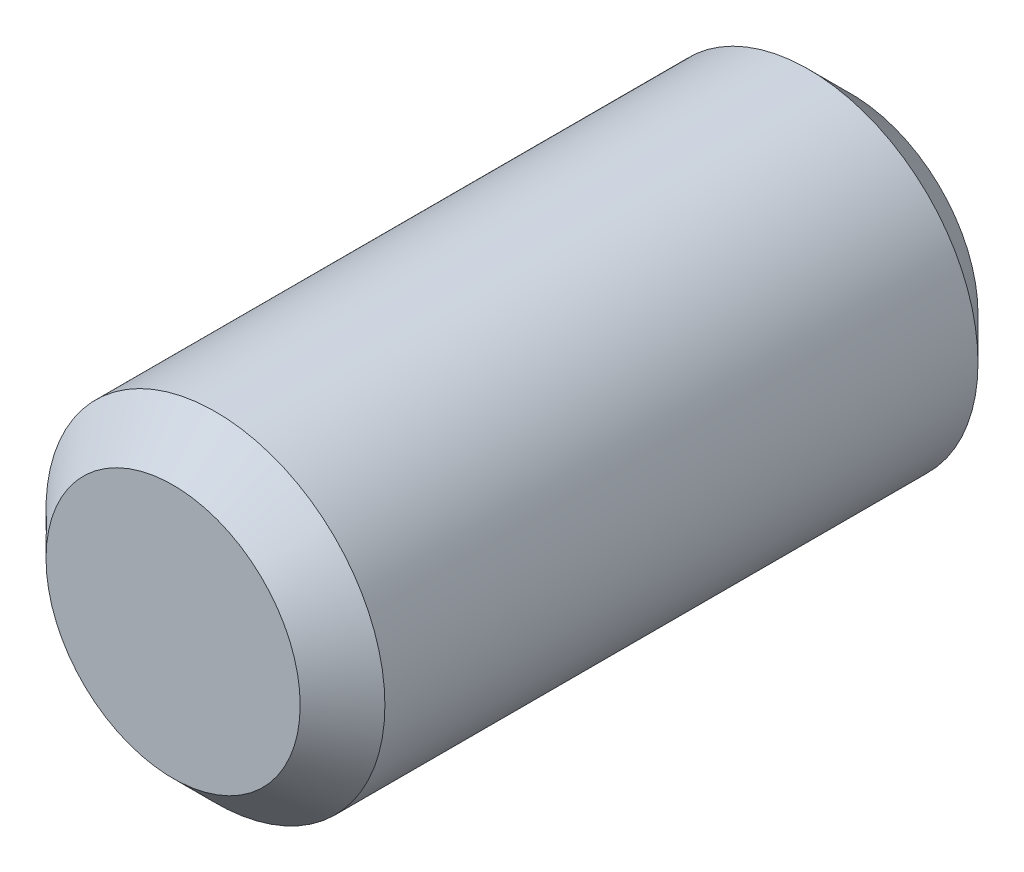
ISO-10303-21;
HEADER;
FILE_DESCRIPTION(('STEP AP214'),'2;1');
FILE_NAME('part.step','',(''),(''),'','','');
FILE_SCHEMA(('AUTOMOTIVE_DESIGN { 1 0 10303 214 1 1 1 1 }'));
ENDSEC;
DATA;
#1=APPLICATION_CONTEXT('core data for automotive mechanical design processes');
#2=APPLICATION_PROTOCOL_DEFINITION('international standard','automotive_design',2000,#1);
#3=PRODUCT_CONTEXT('',#1,'mechanical');
#4=PRODUCT('Part','Part','',(#3));
#5=PRODUCT_RELATED_PRODUCT_CATEGORY('part','',(#4));
#6=PRODUCT_DEFINITION_FORMATION('','',#4);
#7=PRODUCT_DEFINITION_CONTEXT('part definition',#1,'design');
#8=PRODUCT_DEFINITION('design','',#6,#7);
#9=PRODUCT_DEFINITION_SHAPE('','',#8);
#10=(LENGTH_UNIT() NAMED_UNIT(*) SI_UNIT(.MILLI.,.METRE.));
#11=(NAMED_UNIT(*) PLANE_ANGLE_UNIT() SI_UNIT($,.RADIAN.));
#12=(NAMED_UNIT(*) SI_UNIT($,.STERADIAN.) SOLID_ANGLE_UNIT());
#13=UNCERTAINTY_MEASURE_WITH_UNIT(LENGTH_MEASURE(1.E-05),#10,'distance_accuracy_value','');
#14=(GEOMETRIC_REPRESENTATION_CONTEXT(3) GLOBAL_UNCERTAINTY_ASSIGNED_CONTEXT((#13)) GLOBAL_UNIT_ASSIGNED_CONTEXT((#10,
#11,#12)) REPRESENTATION_CONTEXT('',''));
#15=CARTESIAN_POINT('',(0.,0.,0.));
#16=DIRECTION('',(0.,0.,1.));
#17=DIRECTION('',(1.,0.,0.));
#18=AXIS2_PLACEMENT_3D('',#15,#16,#17);
#19=CARTESIAN_POINT('',(0.,0.,8.));
#20=DIRECTION('',(0.,0.,-1.));
#21=DIRECTION('',(-1.,0.,0.));
#22=AXIS2_PLACEMENT_3D('',#19,#20,#21);
#23=CYLINDRICAL_SURFACE('',#22,2.);
#24=CARTESIAN_POINT('',(0.,0.,0.499999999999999));
#25=DIRECTION('',(0.,0.,1.));
#26=DIRECTION('',(1.,0.,0.));
#27=AXIS2_PLACEMENT_3D('',#24,#25,#26);
#28=CIRCLE('',#27,2.);
#29=CARTESIAN_POINT('',(2.,0.,0.499999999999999));
#30=VERTEX_POINT('',#29);
#31=EDGE_CURVE('E144',#30,#30,#28,.T.);
#32=ORIENTED_EDGE('',*,*,#31,.T.);
#33=EDGE_LOOP('',(#32));
#34=FACE_BOUND('',#33,.T.);
#35=CARTESIAN_POINT('',(0.,0.,7.5));
#36=DIRECTION('',(0.,0.,1.));
#37=DIRECTION('',(1.,0.,0.));
#38=AXIS2_PLACEMENT_3D('',#35,#36,#37);
#39=CIRCLE('',#38,2.);
#40=CARTESIAN_POINT('',(2.,0.,7.5));
#41=VERTEX_POINT('',#40);
#42=EDGE_CURVE('E136',#41,#41,#39,.F.);
#43=ORIENTED_EDGE('',*,*,#42,.T.);
#44=EDGE_LOOP('',(#43));
#45=FACE_BOUND('',#44,.T.);
#46=ADVANCED_FACE('F34',(#34,#45),#23,.T.);
#47=CARTESIAN_POINT('',(0.,0.,8.));
#48=DIRECTION('',(0.,0.,1.));
#49=DIRECTION('',(1.,0.,0.));
#50=AXIS2_PLACEMENT_3D('',#47,#48,#49);
#51=PLANE('',#50);
#52=CARTESIAN_POINT('',(0.,0.,8.));
#53=DIRECTION('',(0.,0.,1.));
#54=DIRECTION('',(1.,0.,0.));
#55=AXIS2_PLACEMENT_3D('',#52,#53,#54);
#56=CIRCLE('',#55,1.5);
#57=CARTESIAN_POINT('',(1.5,0.,8.));
#58=VERTEX_POINT('',#57);
#59=EDGE_CURVE('E11',#58,#58,#56,.T.);
#60=ORIENTED_EDGE('',*,*,#59,.T.);
#61=EDGE_LOOP('',(#60));
#62=FACE_BOUND('',#61,.T.);
#63=ADVANCED_FACE('F158',(#62),#51,.T.);
#64=CARTESIAN_POINT('',(0.,0.,0.));
#65=DIRECTION('',(0.,0.,1.));
#66=DIRECTION('',(1.,0.,0.));
#67=AXIS2_PLACEMENT_3D('',#64,#65,#66);
#68=PLANE('',#67);
#69=DIRECTION('',(0.5,0.866025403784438,0.));
#70=VECTOR('',#69,1.);
#71=CARTESIAN_POINT('',(-1.15470053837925,0.,0.));
#72=LINE('',#71,#70);
#73=CARTESIAN_POINT('',(-1.15470053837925,0.,0.));
#74=VERTEX_POINT('',#73);
#75=CARTESIAN_POINT('',(-0.577350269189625,1.,0.));
#76=VERTEX_POINT('',#75);
#77=EDGE_CURVE('E123',#74,#76,#72,.T.);
#78=ORIENTED_EDGE('',*,*,#77,.F.);
#79=DIRECTION('',(-0.5,0.866025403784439,0.));
#80=VECTOR('',#79,1.);
#81=CARTESIAN_POINT('',(-0.577350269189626,-1.,0.));
#82=LINE('',#81,#80);
#83=CARTESIAN_POINT('',(-0.577350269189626,-1.,0.));
#84=VERTEX_POINT('',#83);
#85=EDGE_CURVE('E49',#84,#74,#82,.T.);
#86=ORIENTED_EDGE('',*,*,#85,.F.);
#87=DIRECTION('',(-1.,0.,0.));
#88=VECTOR('',#87,1.);
#89=CARTESIAN_POINT('',(0.577350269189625,-1.,0.));
#90=LINE('',#89,#88);
#91=CARTESIAN_POINT('',(0.577350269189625,-1.,0.));
#92=VERTEX_POINT('',#91);
#93=EDGE_CURVE('E132',#92,#84,#90,.T.);
#94=ORIENTED_EDGE('',*,*,#93,.F.);
#95=DIRECTION('',(-0.5,-0.866025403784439,0.));
#96=VECTOR('',#95,1.);
#97=CARTESIAN_POINT('',(1.15470053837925,0.,0.));
#98=LINE('',#97,#96);
#99=CARTESIAN_POINT('',(1.15470053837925,0.,0.));
#100=VERTEX_POINT('',#99);
#101=EDGE_CURVE('E130',#100,#92,#98,.T.);
#102=ORIENTED_EDGE('',*,*,#101,.F.);
#103=DIRECTION('',(0.5,-0.866025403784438,0.));
#104=VECTOR('',#103,1.);
#105=CARTESIAN_POINT('',(0.577350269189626,1.,0.));
#106=LINE('',#105,#104);
#107=CARTESIAN_POINT('',(0.577350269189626,1.,0.));
#108=VERTEX_POINT('',#107);
#109=EDGE_CURVE('E97',#108,#100,#106,.T.);
#110=ORIENTED_EDGE('',*,*,#109,.F.);
#111=DIRECTION('',(1.,0.,0.));
#112=VECTOR('',#111,1.);
#113=CARTESIAN_POINT('',(-0.577350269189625,1.,0.));
#114=LINE('',#113,#112);
#115=EDGE_CURVE('E126',#76,#108,#114,.T.);
#116=ORIENTED_EDGE('',*,*,#115,.F.);
#117=EDGE_LOOP('',(#78,#86,#94,#102,#110,#116));
#118=FACE_BOUND('',#117,.T.);
#119=CARTESIAN_POINT('',(0.,0.,0.));
#120=DIRECTION('',(0.,0.,1.));
#121=DIRECTION('',(1.,0.,0.));
#122=AXIS2_PLACEMENT_3D('',#119,#120,#121);
#123=CIRCLE('',#122,1.5);
#124=CARTESIAN_POINT('',(1.5,0.,0.));
#125=VERTEX_POINT('',#124);
#126=EDGE_CURVE('E42',#125,#125,#123,.F.);
#127=ORIENTED_EDGE('',*,*,#126,.T.);
#128=EDGE_LOOP('',(#127));
#129=FACE_BOUND('',#128,.T.);
#130=ADVANCED_FACE('F149',(#118,#129),#68,.F.);
#131=CARTESIAN_POINT('',(0.,0.,0.499999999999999));
#132=DIRECTION('',(0.,0.,1.));
#133=DIRECTION('',(1.,0.,0.));
#134=AXIS2_PLACEMENT_3D('',#131,#132,#133);
#135=CONICAL_SURFACE('',#134,2.,0.785398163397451);
#136=ORIENTED_EDGE('',*,*,#126,.F.);
#137=EDGE_LOOP('',(#136));
#138=FACE_BOUND('',#137,.T.);
#139=ORIENTED_EDGE('',*,*,#31,.F.);
#140=EDGE_LOOP('',(#139));
#141=FACE_BOUND('',#140,.T.);
#142=ADVANCED_FACE('F151',(#138,#141),#135,.T.);
#143=CARTESIAN_POINT('',(0.,0.,8.));
#144=DIRECTION('',(0.,0.,-1.));
#145=DIRECTION('',(-1.,0.,0.));
#146=AXIS2_PLACEMENT_3D('',#143,#144,#145);
#147=CONICAL_SURFACE('',#146,1.5,0.785398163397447);
#148=ORIENTED_EDGE('',*,*,#42,.F.);
#149=EDGE_LOOP('',(#148));
#150=FACE_BOUND('',#149,.T.);
#151=ORIENTED_EDGE('',*,*,#59,.F.);
#152=EDGE_LOOP('',(#151));
#153=FACE_BOUND('',#152,.T.);
#154=ADVANCED_FACE('F36',(#150,#153),#147,.T.);
#155=CARTESIAN_POINT('',(-0.577350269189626,-1.,2.));
#156=DIRECTION('',(-0.866025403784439,-0.5,0.));
#157=DIRECTION('',(0.5,-0.866025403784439,0.));
#158=AXIS2_PLACEMENT_3D('',#155,#156,#157);
#159=PLANE('',#158);
#160=ORIENTED_EDGE('',*,*,#85,.T.);
#161=DIRECTION('',(0.,0.,-1.));
#162=VECTOR('',#161,1.);
#163=CARTESIAN_POINT('',(-1.15470053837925,0.,2.));
#164=LINE('',#163,#162);
#165=CARTESIAN_POINT('',(-1.15470053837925,0.,2.));
#166=VERTEX_POINT('',#165);
#167=EDGE_CURVE('E79',#166,#74,#164,.T.);
#168=ORIENTED_EDGE('',*,*,#167,.F.);
#169=DIRECTION('',(-0.5,0.866025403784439,0.));
#170=VECTOR('',#169,1.);
#171=CARTESIAN_POINT('',(-0.577350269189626,-1.,2.));
#172=LINE('',#171,#170);
#173=CARTESIAN_POINT('',(-0.577350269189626,-1.,2.));
#174=VERTEX_POINT('',#173);
#175=EDGE_CURVE('E134',#174,#166,#172,.T.);
#176=ORIENTED_EDGE('',*,*,#175,.F.);
#177=DIRECTION('',(0.,0.,-1.));
#178=VECTOR('',#177,1.);
#179=CARTESIAN_POINT('',(-0.577350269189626,-1.,2.));
#180=LINE('',#179,#178);
#181=EDGE_CURVE('E57',#174,#84,#180,.T.);
#182=ORIENTED_EDGE('',*,*,#181,.T.);
#183=EDGE_LOOP('',(#160,#168,#176,#182));
#184=FACE_BOUND('',#183,.T.);
#185=ADVANCED_FACE('F164',(#184),#159,.F.);
#186=CARTESIAN_POINT('',(0.577350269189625,-1.,2.));
#187=DIRECTION('',(0.,-1.,0.));
#188=DIRECTION('',(1.,0.,0.));
#189=AXIS2_PLACEMENT_3D('',#186,#187,#188);
#190=PLANE('',#189);
#191=ORIENTED_EDGE('',*,*,#93,.T.);
#192=ORIENTED_EDGE('',*,*,#181,.F.);
#193=DIRECTION('',(-1.,0.,0.));
#194=VECTOR('',#193,1.);
#195=CARTESIAN_POINT('',(0.577350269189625,-1.,2.));
#196=LINE('',#195,#194);
#197=CARTESIAN_POINT('',(0.577350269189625,-1.,2.));
#198=VERTEX_POINT('',#197);
#199=EDGE_CURVE('E109',#198,#174,#196,.T.);
#200=ORIENTED_EDGE('',*,*,#199,.F.);
#201=DIRECTION('',(0.,0.,-1.));
#202=VECTOR('',#201,1.);
#203=CARTESIAN_POINT('',(0.577350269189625,-1.,2.));
#204=LINE('',#203,#202);
#205=EDGE_CURVE('E101',#198,#92,#204,.T.);
#206=ORIENTED_EDGE('',*,*,#205,.T.);
#207=EDGE_LOOP('',(#191,#192,#200,#206));
#208=FACE_BOUND('',#207,.T.);
#209=ADVANCED_FACE('F177',(#208),#190,.F.);
#210=CARTESIAN_POINT('',(1.15470053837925,0.,2.));
#211=DIRECTION('',(0.866025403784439,-0.5,0.));
#212=DIRECTION('',(0.5,0.866025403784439,0.));
#213=AXIS2_PLACEMENT_3D('',#210,#211,#212);
#214=PLANE('',#213);
#215=ORIENTED_EDGE('',*,*,#101,.T.);
#216=ORIENTED_EDGE('',*,*,#205,.F.);
#217=DIRECTION('',(-0.5,-0.866025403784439,0.));
#218=VECTOR('',#217,1.);
#219=CARTESIAN_POINT('',(1.15470053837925,0.,2.));
#220=LINE('',#219,#218);
#221=CARTESIAN_POINT('',(1.15470053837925,0.,2.));
#222=VERTEX_POINT('',#221);
#223=EDGE_CURVE('E105',#222,#198,#220,.T.);
#224=ORIENTED_EDGE('',*,*,#223,.F.);
#225=DIRECTION('',(0.,0.,-1.));
#226=VECTOR('',#225,1.);
#227=CARTESIAN_POINT('',(1.15470053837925,0.,2.));
#228=LINE('',#227,#226);
#229=EDGE_CURVE('E90',#222,#100,#228,.T.);
#230=ORIENTED_EDGE('',*,*,#229,.T.);
#231=EDGE_LOOP('',(#215,#216,#224,#230));
#232=FACE_BOUND('',#231,.T.);
#233=ADVANCED_FACE('F106',(#232),#214,.F.);
#234=CARTESIAN_POINT('',(0.577350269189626,1.,2.));
#235=DIRECTION('',(0.866025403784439,0.5,0.));
#236=DIRECTION('',(-0.5,0.866025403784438,0.));
#237=AXIS2_PLACEMENT_3D('',#234,#235,#236);
#238=PLANE('',#237);
#239=ORIENTED_EDGE('',*,*,#109,.T.);
#240=ORIENTED_EDGE('',*,*,#229,.F.);
#241=DIRECTION('',(0.5,-0.866025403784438,0.));
#242=VECTOR('',#241,1.);
#243=CARTESIAN_POINT('',(0.577350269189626,1.,2.));
#244=LINE('',#243,#242);
#245=CARTESIAN_POINT('',(0.577350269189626,1.,2.));
#246=VERTEX_POINT('',#245);
#247=EDGE_CURVE('E94',#246,#222,#244,.T.);
#248=ORIENTED_EDGE('',*,*,#247,.F.);
#249=DIRECTION('',(0.,0.,-1.));
#250=VECTOR('',#249,1.);
#251=CARTESIAN_POINT('',(0.577350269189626,1.,2.));
#252=LINE('',#251,#250);
#253=EDGE_CURVE('E102',#246,#108,#252,.T.);
#254=ORIENTED_EDGE('',*,*,#253,.T.);
#255=EDGE_LOOP('',(#239,#240,#248,#254));
#256=FACE_BOUND('',#255,.T.);
#257=ADVANCED_FACE('F92',(#256),#238,.F.);
#258=CARTESIAN_POINT('',(-0.577350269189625,1.,2.));
#259=DIRECTION('',(0.,1.,0.));
#260=DIRECTION('',(0.,0.,1.));
#261=AXIS2_PLACEMENT_3D('',#258,#259,#260);
#262=PLANE('',#261);
#263=ORIENTED_EDGE('',*,*,#115,.T.);
#264=ORIENTED_EDGE('',*,*,#253,.F.);
#265=DIRECTION('',(1.,0.,0.));
#266=VECTOR('',#265,1.);
#267=CARTESIAN_POINT('',(-0.577350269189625,1.,2.));
#268=LINE('',#267,#266);
#269=CARTESIAN_POINT('',(-0.577350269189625,1.,2.));
#270=VERTEX_POINT('',#269);
#271=EDGE_CURVE('E115',#270,#246,#268,.T.);
#272=ORIENTED_EDGE('',*,*,#271,.F.);
#273=DIRECTION('',(0.,0.,-1.));
#274=VECTOR('',#273,1.);
#275=CARTESIAN_POINT('',(-0.577350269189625,1.,2.));
#276=LINE('',#275,#274);
#277=EDGE_CURVE('E139',#270,#76,#276,.T.);
#278=ORIENTED_EDGE('',*,*,#277,.T.);
#279=EDGE_LOOP('',(#263,#264,#272,#278));
#280=FACE_BOUND('',#279,.T.);
#281=ADVANCED_FACE('F181',(#280),#262,.F.);
#282=CARTESIAN_POINT('',(-1.15470053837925,0.,2.));
#283=DIRECTION('',(-0.866025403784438,0.5,0.));
#284=DIRECTION('',(-0.5,-0.866025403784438,0.));
#285=AXIS2_PLACEMENT_3D('',#282,#283,#284);
#286=PLANE('',#285);
#287=ORIENTED_EDGE('',*,*,#77,.T.);
#288=ORIENTED_EDGE('',*,*,#277,.F.);
#289=DIRECTION('',(0.5,0.866025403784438,0.));
#290=VECTOR('',#289,1.);
#291=CARTESIAN_POINT('',(-1.15470053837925,0.,2.));
#292=LINE('',#291,#290);
#293=EDGE_CURVE('E117',#166,#270,#292,.T.);
#294=ORIENTED_EDGE('',*,*,#293,.F.);
#295=ORIENTED_EDGE('',*,*,#167,.T.);
#296=EDGE_LOOP('',(#287,#288,#294,#295));
#297=FACE_BOUND('',#296,.T.);
#298=ADVANCED_FACE('F178',(#297),#286,.F.);
#299=CARTESIAN_POINT('',(-1.15470053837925,0.,2.));
#300=DIRECTION('',(0.,0.,-1.));
#301=DIRECTION('',(-1.,0.,0.));
#302=AXIS2_PLACEMENT_3D('',#299,#300,#301);
#303=PLANE('',#302);
#304=ORIENTED_EDGE('',*,*,#175,.T.);
#305=ORIENTED_EDGE('',*,*,#293,.T.);
#306=ORIENTED_EDGE('',*,*,#271,.T.);
#307=ORIENTED_EDGE('',*,*,#247,.T.);
#308=ORIENTED_EDGE('',*,*,#223,.T.);
#309=ORIENTED_EDGE('',*,*,#199,.T.);
#310=EDGE_LOOP('',(#304,#305,#306,#307,#308,#309));
#311=FACE_BOUND('',#310,.T.);
#312=ADVANCED_FACE('F112',(#311),#303,.T.);
#313=CLOSED_SHELL('',(#46,#63,#130,#142,#154,#185,#209,#233,#257,#281,#298,#312));
#314=MANIFOLD_SOLID_BREP('B2',#313);
#315=ADVANCED_BREP_SHAPE_REPRESENTATION('',(#18,#314),#14);
#316=SHAPE_DEFINITION_REPRESENTATION(#9,#315);
ENDSEC;
END-ISO-10303-21;
